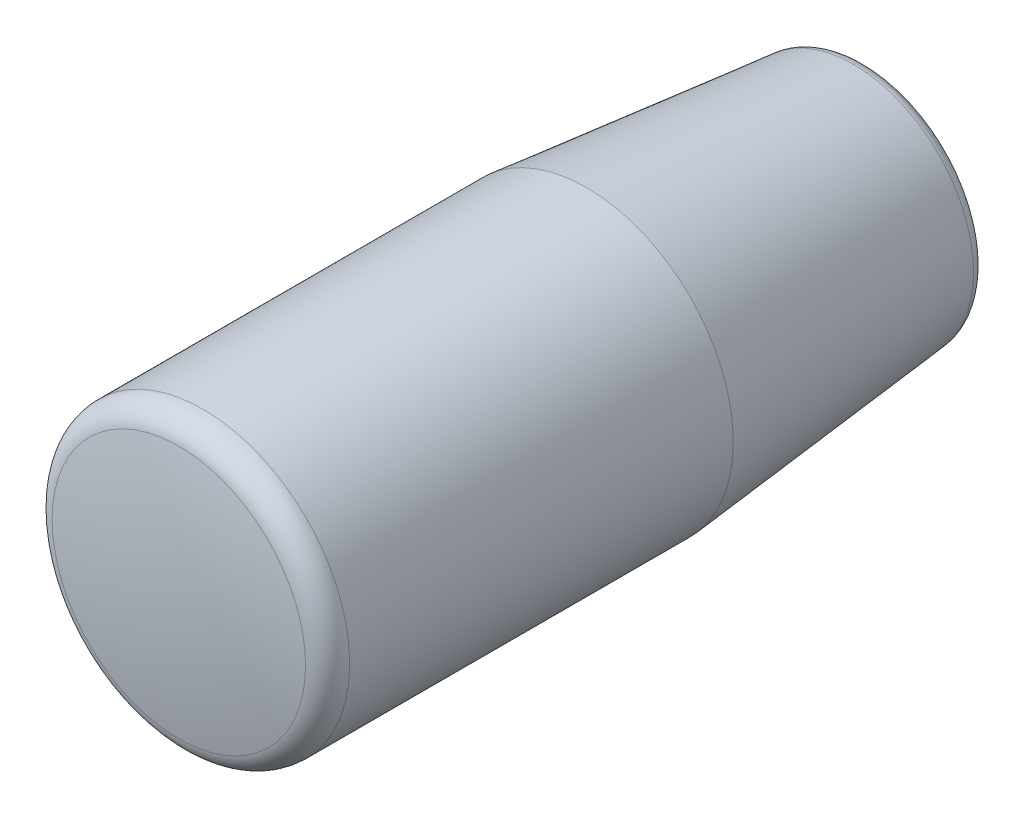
ISO-10303-21;
HEADER;
FILE_DESCRIPTION(('STEP AP214'),'2;1');
FILE_NAME('part.step','',(''),(''),'','','');
FILE_SCHEMA(('AUTOMOTIVE_DESIGN { 1 0 10303 214 1 1 1 1 }'));
ENDSEC;
DATA;
#1=APPLICATION_CONTEXT('core data for automotive mechanical design processes');
#2=APPLICATION_PROTOCOL_DEFINITION('international standard','automotive_design',2000,#1);
#3=PRODUCT_CONTEXT('',#1,'mechanical');
#4=PRODUCT('Part','Part','',(#3));
#5=PRODUCT_RELATED_PRODUCT_CATEGORY('part','',(#4));
#6=PRODUCT_DEFINITION_FORMATION('','',#4);
#7=PRODUCT_DEFINITION_CONTEXT('part definition',#1,'design');
#8=PRODUCT_DEFINITION('design','',#6,#7);
#9=PRODUCT_DEFINITION_SHAPE('','',#8);
#10=(LENGTH_UNIT() NAMED_UNIT(*) SI_UNIT(.MILLI.,.METRE.));
#11=(NAMED_UNIT(*) PLANE_ANGLE_UNIT() SI_UNIT($,.RADIAN.));
#12=(NAMED_UNIT(*) SI_UNIT($,.STERADIAN.) SOLID_ANGLE_UNIT());
#13=UNCERTAINTY_MEASURE_WITH_UNIT(LENGTH_MEASURE(1.E-05),#10,'distance_accuracy_value','');
#14=(GEOMETRIC_REPRESENTATION_CONTEXT(3) GLOBAL_UNCERTAINTY_ASSIGNED_CONTEXT((#13)) GLOBAL_UNIT_ASSIGNED_CONTEXT((#10,
#11,#12)) REPRESENTATION_CONTEXT('',''));
#15=CARTESIAN_POINT('',(0.,0.,0.));
#16=DIRECTION('',(0.,0.,1.));
#17=DIRECTION('',(1.,0.,0.));
#18=AXIS2_PLACEMENT_3D('',#15,#16,#17);
#19=CARTESIAN_POINT('',(0.,0.,47.449973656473));
#20=DIRECTION('',(0.,0.,-1.));
#21=DIRECTION('',(-1.,0.,0.));
#22=AXIS2_PLACEMENT_3D('',#19,#20,#21);
#23=TOROIDAL_SURFACE('',#22,8.75,1.75);
#24=CARTESIAN_POINT('',(0.,0.,47.449973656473));
#25=DIRECTION('',(0.,0.,-1.));
#26=DIRECTION('',(-1.,0.,0.));
#27=AXIS2_PLACEMENT_3D('',#24,#25,#26);
#28=CIRCLE('',#27,10.5);
#29=CARTESIAN_POINT('',(-10.5,0.,47.449973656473));
#30=VERTEX_POINT('',#29);
#31=EDGE_CURVE('E8',#30,#30,#28,.T.);
#32=ORIENTED_EDGE('',*,*,#31,.F.);
#33=EDGE_LOOP('',(#32));
#34=FACE_BOUND('',#33,.T.);
#35=CARTESIAN_POINT('',(0.,0.,49.170957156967));
#36=DIRECTION('',(0.,0.,-1.));
#37=DIRECTION('',(-1.,0.,0.));
#38=AXIS2_PLACEMENT_3D('',#35,#36,#37);
#39=CIRCLE('',#38,9.06735751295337);
#40=CARTESIAN_POINT('',(-9.06735751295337,0.,49.170957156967));
#41=VERTEX_POINT('',#40);
#42=EDGE_CURVE('E43',#41,#41,#39,.T.);
#43=ORIENTED_EDGE('',*,*,#42,.T.);
#44=EDGE_LOOP('',(#43));
#45=FACE_BOUND('',#44,.T.);
#46=ADVANCED_FACE('F12',(#34,#45),#23,.T.);
#47=CARTESIAN_POINT('',(0.,0.,-5.));
#48=DIRECTION('',(0.,0.,-1.));
#49=DIRECTION('',(-1.,0.,0.));
#50=AXIS2_PLACEMENT_3D('',#47,#48,#49);
#51=CYLINDRICAL_SURFACE('',#50,10.5);
#52=CARTESIAN_POINT('',(0.,0.,20.));
#53=DIRECTION('',(0.,0.,-1.));
#54=DIRECTION('',(-1.,0.,0.));
#55=AXIS2_PLACEMENT_3D('',#52,#53,#54);
#56=CIRCLE('',#55,10.5);
#57=CARTESIAN_POINT('',(-10.5,0.,20.));
#58=VERTEX_POINT('',#57);
#59=EDGE_CURVE('E18',#58,#58,#56,.T.);
#60=ORIENTED_EDGE('',*,*,#59,.F.);
#61=EDGE_LOOP('',(#60));
#62=FACE_BOUND('',#61,.T.);
#63=ORIENTED_EDGE('',*,*,#31,.T.);
#64=EDGE_LOOP('',(#63));
#65=FACE_BOUND('',#64,.T.);
#66=ADVANCED_FACE('F61',(#62,#65),#51,.T.);
#67=CARTESIAN_POINT('',(0.,0.,20.));
#68=DIRECTION('',(0.,0.,1.));
#69=DIRECTION('',(1.,0.,0.));
#70=AXIS2_PLACEMENT_3D('',#67,#68,#69);
#71=CONICAL_SURFACE('',#70,10.5,0.099668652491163);
#72=CARTESIAN_POINT('',(0.,0.,0.900496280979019));
#73=DIRECTION('',(0.,0.,-1.));
#74=DIRECTION('',(-1.,0.,0.));
#75=AXIS2_PLACEMENT_3D('',#72,#73,#74);
#76=CIRCLE('',#75,8.5900496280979);
#77=CARTESIAN_POINT('',(-8.5900496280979,0.,0.900496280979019));
#78=VERTEX_POINT('',#77);
#79=EDGE_CURVE('E22',#78,#78,#76,.T.);
#80=ORIENTED_EDGE('',*,*,#79,.F.);
#81=EDGE_LOOP('',(#80));
#82=FACE_BOUND('',#81,.T.);
#83=ORIENTED_EDGE('',*,*,#59,.T.);
#84=EDGE_LOOP('',(#83));
#85=FACE_BOUND('',#84,.T.);
#86=ADVANCED_FACE('F67',(#82,#85),#71,.T.);
#87=CARTESIAN_POINT('',(0.,0.,1.));
#88=DIRECTION('',(0.,0.,-1.));
#89=DIRECTION('',(-1.,0.,0.));
#90=AXIS2_PLACEMENT_3D('',#87,#88,#89);
#91=TOROIDAL_SURFACE('',#90,7.59501243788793,0.999999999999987);
#92=CARTESIAN_POINT('',(0.,0.,0.));
#93=DIRECTION('',(0.,0.,-1.));
#94=DIRECTION('',(-1.,0.,0.));
#95=AXIS2_PLACEMENT_3D('',#92,#93,#94);
#96=CIRCLE('',#95,7.59501243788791);
#97=CARTESIAN_POINT('',(-7.59501243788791,0.,0.));
#98=VERTEX_POINT('',#97);
#99=EDGE_CURVE('E26',#98,#98,#96,.T.);
#100=ORIENTED_EDGE('',*,*,#99,.F.);
#101=EDGE_LOOP('',(#100));
#102=FACE_BOUND('',#101,.T.);
#103=ORIENTED_EDGE('',*,*,#79,.T.);
#104=EDGE_LOOP('',(#103));
#105=FACE_BOUND('',#104,.T.);
#106=ADVANCED_FACE('F73',(#102,#105),#91,.T.);
#107=CARTESIAN_POINT('',(0.,7.59501243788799,0.));
#108=DIRECTION('',(0.,0.,1.));
#109=DIRECTION('',(1.,0.,0.));
#110=AXIS2_PLACEMENT_3D('',#107,#108,#109);
#111=PLANE('',#110);
#112=CARTESIAN_POINT('',(0.,0.,0.));
#113=DIRECTION('',(0.,0.,-1.));
#114=DIRECTION('',(-1.,0.,0.));
#115=AXIS2_PLACEMENT_3D('',#112,#113,#114);
#116=CIRCLE('',#115,4.25);
#117=CARTESIAN_POINT('',(-4.25,0.,0.));
#118=VERTEX_POINT('',#117);
#119=EDGE_CURVE('E31',#118,#118,#116,.T.);
#120=ORIENTED_EDGE('',*,*,#119,.F.);
#121=EDGE_LOOP('',(#120));
#122=FACE_BOUND('',#121,.T.);
#123=ORIENTED_EDGE('',*,*,#99,.T.);
#124=EDGE_LOOP('',(#123));
#125=FACE_BOUND('',#124,.T.);
#126=ADVANCED_FACE('F79',(#122,#125),#111,.F.);
#127=CARTESIAN_POINT('',(0.,0.,-5.));
#128=DIRECTION('',(0.,0.,-1.));
#129=DIRECTION('',(-1.,0.,0.));
#130=AXIS2_PLACEMENT_3D('',#127,#128,#129);
#131=CYLINDRICAL_SURFACE('',#130,4.25);
#132=CARTESIAN_POINT('',(0.,0.,7.5));
#133=DIRECTION('',(0.,0.,-1.));
#134=DIRECTION('',(-1.,0.,0.));
#135=AXIS2_PLACEMENT_3D('',#132,#133,#134);
#136=CIRCLE('',#135,4.25);
#137=CARTESIAN_POINT('',(-4.25,0.,7.5));
#138=VERTEX_POINT('',#137);
#139=EDGE_CURVE('E34',#138,#138,#136,.T.);
#140=ORIENTED_EDGE('',*,*,#139,.F.);
#141=EDGE_LOOP('',(#140));
#142=FACE_BOUND('',#141,.T.);
#143=ORIENTED_EDGE('',*,*,#119,.T.);
#144=EDGE_LOOP('',(#143));
#145=FACE_BOUND('',#144,.T.);
#146=ADVANCED_FACE('F83',(#142,#145),#131,.F.);
#147=CARTESIAN_POINT('',(0.,4.25,7.5));
#148=DIRECTION('',(0.,0.,1.));
#149=DIRECTION('',(1.,0.,0.));
#150=AXIS2_PLACEMENT_3D('',#147,#148,#149);
#151=PLANE('',#150);
#152=CARTESIAN_POINT('',(0.,0.,7.5));
#153=DIRECTION('',(0.,0.,-1.));
#154=DIRECTION('',(-1.,0.,0.));
#155=AXIS2_PLACEMENT_3D('',#152,#153,#154);
#156=CIRCLE('',#155,4.);
#157=CARTESIAN_POINT('',(-4.,0.,7.5));
#158=VERTEX_POINT('',#157);
#159=EDGE_CURVE('E37',#158,#158,#156,.T.);
#160=ORIENTED_EDGE('',*,*,#159,.F.);
#161=EDGE_LOOP('',(#160));
#162=FACE_BOUND('',#161,.T.);
#163=ORIENTED_EDGE('',*,*,#139,.T.);
#164=EDGE_LOOP('',(#163));
#165=FACE_BOUND('',#164,.T.);
#166=ADVANCED_FACE('F87',(#162,#165),#151,.F.);
#167=CARTESIAN_POINT('',(0.,0.,-5.));
#168=DIRECTION('',(0.,0.,-1.));
#169=DIRECTION('',(-1.,0.,0.));
#170=AXIS2_PLACEMENT_3D('',#167,#168,#169);
#171=CYLINDRICAL_SURFACE('',#170,4.);
#172=CARTESIAN_POINT('',(0.,0.,35.));
#173=DIRECTION('',(0.,0.,-1.));
#174=DIRECTION('',(-1.,0.,0.));
#175=AXIS2_PLACEMENT_3D('',#172,#173,#174);
#176=CIRCLE('',#175,4.);
#177=CARTESIAN_POINT('',(-4.,0.,35.));
#178=VERTEX_POINT('',#177);
#179=EDGE_CURVE('E40',#178,#178,#176,.T.);
#180=ORIENTED_EDGE('',*,*,#179,.F.);
#181=EDGE_LOOP('',(#180));
#182=FACE_BOUND('',#181,.T.);
#183=ORIENTED_EDGE('',*,*,#159,.T.);
#184=EDGE_LOOP('',(#183));
#185=FACE_BOUND('',#184,.T.);
#186=ADVANCED_FACE('F57',(#182,#185),#171,.F.);
#187=CARTESIAN_POINT('',(0.,4.,35.));
#188=DIRECTION('',(0.,0.,1.));
#189=DIRECTION('',(1.,0.,0.));
#190=AXIS2_PLACEMENT_3D('',#187,#188,#189);
#191=PLANE('',#190);
#192=ORIENTED_EDGE('',*,*,#179,.T.);
#193=EDGE_LOOP('',(#192));
#194=FACE_BOUND('',#193,.T.);
#195=ADVANCED_FACE('F50',(#194),#191,.F.);
#196=CARTESIAN_POINT('',(0.,0.,0.));
#197=DIRECTION('',(-1.,0.,0.));
#198=DIRECTION('',(0.,0.,1.));
#199=AXIS2_PLACEMENT_3D('',#196,#197,#198);
#200=SPHERICAL_SURFACE('',#199,50.);
#201=CARTESIAN_POINT('',(0.,0.,0.));
#202=DIRECTION('',(0.,0.,-1.));
#203=DIRECTION('',(-1.,0.,0.));
#204=AXIS2_PLACEMENT_3D('',#201,#202,#203);
#205=SPHERICAL_SURFACE('',#204,50.);
#206=ORIENTED_EDGE('',*,*,#42,.F.);
#207=EDGE_LOOP('',(#206));
#208=FACE_BOUND('',#207,.T.);
#209=ADVANCED_FACE('F48',(#208),#205,.T.);
#210=CLOSED_SHELL('',(#46,#66,#86,#106,#126,#146,#166,#186,#195,#209));
#211=MANIFOLD_SOLID_BREP('B1',#210);
#212=ADVANCED_BREP_SHAPE_REPRESENTATION('',(#18,#211),#14);
#213=SHAPE_DEFINITION_REPRESENTATION(#9,#212);
ENDSEC;
END-ISO-10303-21;
